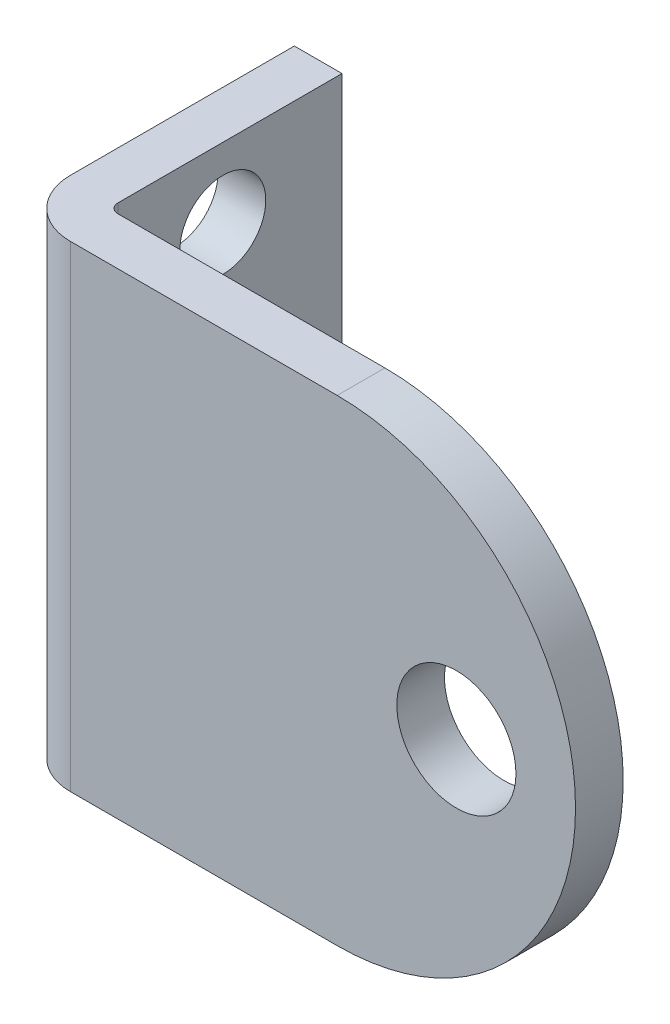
from build123d import *

# Parameters (mm, degrees)
ESQUISSE1_R             = 6.25
EXTRUSION1_DEPTH        = 5
ESQUISSE2_W             = 5
ESQUISSE2_H             = 50
EXTRUSION2_DEPTH        = 29.5
CONG_1_R                = 6
CONG_2_R                = 1
ESQUISSE3_R             = 4.5
ENL_V_MAT_EXTRU_1_DEPTH = 69.60211367


with BuildPart() as part:
    # Esquisse1 → Extrusion1 (new body)
    with BuildSketch(Plane.XY):
        with BuildLine():
            Line((0, 25), (34, 25))
            ThreePointArc((34, 25), (59, 0), (34, -25))
            Line((34, -25), (0, -25))
            Line((0, -25), (0, 25))
        make_face()
        with Locations((46.5, 0)):
            Circle(ESQUISSE1_R, mode=Mode.SUBTRACT)
    extrude(amount=EXTRUSION1_DEPTH)

    # Esquisse2 → Extrusion2 (add)
    with BuildSketch(Plane.XY.offset(5)):
        with Locations((2.5, 0)):
            Rectangle(ESQUISSE2_W, ESQUISSE2_H)
    extrude(amount=-EXTRUSION2_DEPTH)

    # Cong_1
    cong_1_edges = [part.edges().sort_by_distance(p)[0] for p in [
        (0, 0, 5),
    ]]
    fillet(cong_1_edges, radius=CONG_1_R)

    # Cong_2
    cong_2_edges = [part.edges().sort_by_distance(p)[0] for p in [
        (5, 0, 0),
    ]]
    fillet(cong_2_edges, radius=CONG_2_R)

    # Esquisse3 → Enl_v. mat.-Extru.1 (cut, through all)
    with BuildSketch(Plane.ZY):
        with Locations(Location((-12, -17.5, 0), (0, 0, 270))):
            Circle(ESQUISSE3_R)
        with Locations(Location((-12, 17.5, 0), (0, 0, 270))):
            Circle(ESQUISSE3_R)
    extrude(amount=-ENL_V_MAT_EXTRU_1_DEPTH, mode=Mode.SUBTRACT)


solid = part.part
